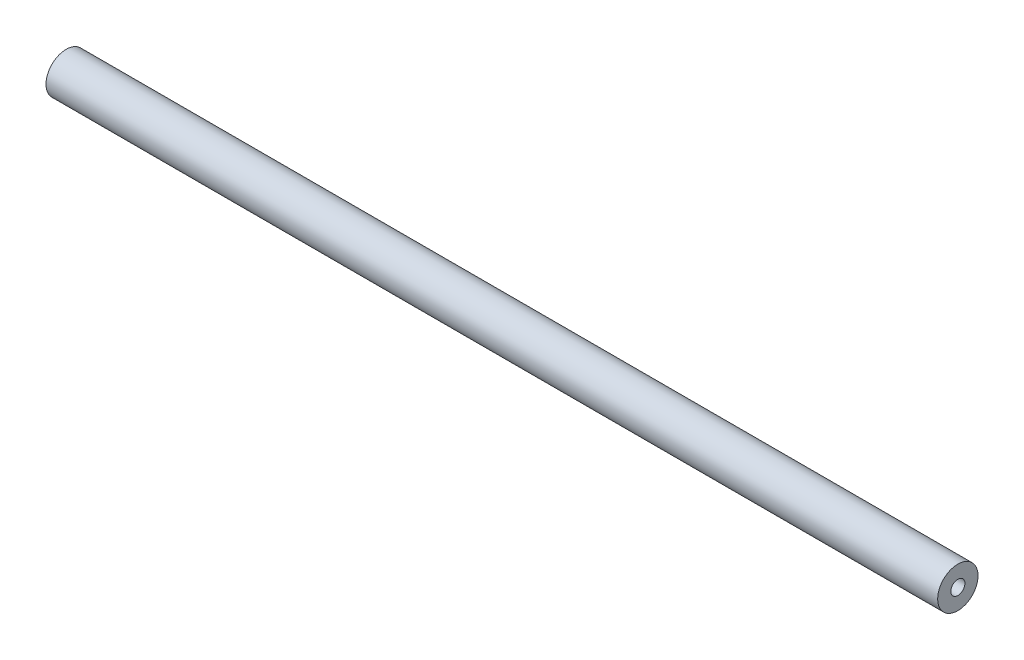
ISO-10303-21;
HEADER;
FILE_DESCRIPTION(('STEP AP214'),'2;1');
FILE_NAME('part.step','',(''),(''),'','','');
FILE_SCHEMA(('AUTOMOTIVE_DESIGN { 1 0 10303 214 1 1 1 1 }'));
ENDSEC;
DATA;
#1=APPLICATION_CONTEXT('core data for automotive mechanical design processes');
#2=APPLICATION_PROTOCOL_DEFINITION('international standard','automotive_design',2000,#1);
#3=PRODUCT_CONTEXT('',#1,'mechanical');
#4=PRODUCT('Part','Part','',(#3));
#5=PRODUCT_RELATED_PRODUCT_CATEGORY('part','',(#4));
#6=PRODUCT_DEFINITION_FORMATION('','',#4);
#7=PRODUCT_DEFINITION_CONTEXT('part definition',#1,'design');
#8=PRODUCT_DEFINITION('design','',#6,#7);
#9=PRODUCT_DEFINITION_SHAPE('','',#8);
#10=(LENGTH_UNIT() NAMED_UNIT(*) SI_UNIT(.MILLI.,.METRE.));
#11=(NAMED_UNIT(*) PLANE_ANGLE_UNIT() SI_UNIT($,.RADIAN.));
#12=(NAMED_UNIT(*) SI_UNIT($,.STERADIAN.) SOLID_ANGLE_UNIT());
#13=UNCERTAINTY_MEASURE_WITH_UNIT(LENGTH_MEASURE(1.E-05),#10,'distance_accuracy_value','');
#14=(GEOMETRIC_REPRESENTATION_CONTEXT(3) GLOBAL_UNCERTAINTY_ASSIGNED_CONTEXT((#13)) GLOBAL_UNIT_ASSIGNED_CONTEXT((#10,
#11,#12)) REPRESENTATION_CONTEXT('',''));
#15=CARTESIAN_POINT('',(0.,0.,0.));
#16=DIRECTION('',(0.,0.,1.));
#17=DIRECTION('',(1.,0.,0.));
#18=AXIS2_PLACEMENT_3D('',#15,#16,#17);
#19=CARTESIAN_POINT('',(250.99999999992,0.,0.));
#20=DIRECTION('',(1.,0.,0.));
#21=DIRECTION('',(0.,0.,-1.));
#22=AXIS2_PLACEMENT_3D('',#19,#20,#21);
#23=CONICAL_SURFACE('',#22,2.0999999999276,1.02974425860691);
#24=CARTESIAN_POINT('',(249.738192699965,0.,0.));
#25=VERTEX_POINT('',#24);
#26=VERTEX_LOOP('',#25);
#27=FACE_BOUND('',#26,.T.);
#28=CARTESIAN_POINT('',(251.,0.,0.));
#29=DIRECTION('',(1.,0.,0.));
#30=DIRECTION('',(0.,0.,-1.));
#31=AXIS2_PLACEMENT_3D('',#28,#29,#30);
#32=CIRCLE('',#31,2.1);
#33=CARTESIAN_POINT('',(251.,0.,-2.1));
#34=VERTEX_POINT('',#33);
#35=EDGE_CURVE('E37',#34,#34,#32,.T.);
#36=ORIENTED_EDGE('',*,*,#35,.T.);
#37=EDGE_LOOP('',(#36));
#38=FACE_BOUND('',#37,.T.);
#39=ADVANCED_FACE('F17',(#27,#38),#23,.F.);
#40=CARTESIAN_POINT('',(14.00000000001,0.,0.));
#41=DIRECTION('',(-1.,0.,0.));
#42=DIRECTION('',(0.,0.,1.));
#43=AXIS2_PLACEMENT_3D('',#40,#41,#42);
#44=CONICAL_SURFACE('',#43,2.10000000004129,1.02974425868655);
#45=CARTESIAN_POINT('',(15.2618072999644,0.,0.));
#46=VERTEX_POINT('',#45);
#47=VERTEX_LOOP('',#46);
#48=FACE_BOUND('',#47,.T.);
#49=CARTESIAN_POINT('',(14.,0.,0.));
#50=DIRECTION('',(-1.,0.,0.));
#51=DIRECTION('',(0.,0.,1.));
#52=AXIS2_PLACEMENT_3D('',#49,#50,#51);
#53=CIRCLE('',#52,2.09999999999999);
#54=CARTESIAN_POINT('',(14.,0.,2.09999999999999));
#55=VERTEX_POINT('',#54);
#56=EDGE_CURVE('E39',#55,#55,#53,.T.);
#57=ORIENTED_EDGE('',*,*,#56,.T.);
#58=EDGE_LOOP('',(#57));
#59=FACE_BOUND('',#58,.T.);
#60=ADVANCED_FACE('F34',(#48,#59),#44,.F.);
#61=CARTESIAN_POINT('',(265.,0.,0.));
#62=DIRECTION('',(1.,0.,0.));
#63=DIRECTION('',(0.,0.,-1.));
#64=AXIS2_PLACEMENT_3D('',#61,#62,#63);
#65=CYLINDRICAL_SURFACE('',#64,2.1);
#66=CARTESIAN_POINT('',(265.,0.,0.));
#67=DIRECTION('',(1.,0.,0.));
#68=DIRECTION('',(0.,0.,-1.));
#69=AXIS2_PLACEMENT_3D('',#66,#67,#68);
#70=CIRCLE('',#69,2.1);
#71=CARTESIAN_POINT('',(265.,0.,-2.1));
#72=VERTEX_POINT('',#71);
#73=EDGE_CURVE('E20',#72,#72,#70,.F.);
#74=ORIENTED_EDGE('',*,*,#73,.F.);
#75=EDGE_LOOP('',(#74));
#76=FACE_BOUND('',#75,.T.);
#77=ORIENTED_EDGE('',*,*,#35,.F.);
#78=EDGE_LOOP('',(#77));
#79=FACE_BOUND('',#78,.T.);
#80=ADVANCED_FACE('F54',(#76,#79),#65,.F.);
#81=CARTESIAN_POINT('',(0.,0.,0.));
#82=DIRECTION('',(-1.,0.,0.));
#83=DIRECTION('',(0.,0.,1.));
#84=AXIS2_PLACEMENT_3D('',#81,#82,#83);
#85=CYLINDRICAL_SURFACE('',#84,2.09999999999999);
#86=ORIENTED_EDGE('',*,*,#56,.F.);
#87=EDGE_LOOP('',(#86));
#88=FACE_BOUND('',#87,.T.);
#89=CARTESIAN_POINT('',(0.,0.,0.));
#90=DIRECTION('',(-1.,0.,0.));
#91=DIRECTION('',(0.,0.,1.));
#92=AXIS2_PLACEMENT_3D('',#89,#90,#91);
#93=CIRCLE('',#92,2.09999999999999);
#94=CARTESIAN_POINT('',(0.,0.,2.09999999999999));
#95=VERTEX_POINT('',#94);
#96=EDGE_CURVE('E45',#95,#95,#93,.T.);
#97=ORIENTED_EDGE('',*,*,#96,.T.);
#98=EDGE_LOOP('',(#97));
#99=FACE_BOUND('',#98,.T.);
#100=ADVANCED_FACE('F56',(#88,#99),#85,.F.);
#101=CARTESIAN_POINT('',(265.,0.,0.));
#102=DIRECTION('',(1.,0.,0.));
#103=DIRECTION('',(0.,0.,-1.));
#104=AXIS2_PLACEMENT_3D('',#101,#102,#103);
#105=PLANE('',#104);
#106=CARTESIAN_POINT('',(265.,0.,0.));
#107=DIRECTION('',(-1.,0.,0.));
#108=DIRECTION('',(0.,0.,1.));
#109=AXIS2_PLACEMENT_3D('',#106,#107,#108);
#110=CIRCLE('',#109,6.);
#111=CARTESIAN_POINT('',(265.,0.,6.));
#112=VERTEX_POINT('',#111);
#113=EDGE_CURVE('E26',#112,#112,#110,.T.);
#114=ORIENTED_EDGE('',*,*,#113,.F.);
#115=EDGE_LOOP('',(#114));
#116=FACE_BOUND('',#115,.T.);
#117=ORIENTED_EDGE('',*,*,#73,.T.);
#118=EDGE_LOOP('',(#117));
#119=FACE_BOUND('',#118,.T.);
#120=ADVANCED_FACE('F52',(#116,#119),#105,.T.);
#121=CARTESIAN_POINT('',(0.,0.,0.));
#122=DIRECTION('',(1.,0.,0.));
#123=DIRECTION('',(0.,0.,-1.));
#124=AXIS2_PLACEMENT_3D('',#121,#122,#123);
#125=PLANE('',#124);
#126=CARTESIAN_POINT('',(0.,0.,0.));
#127=DIRECTION('',(-1.,0.,0.));
#128=DIRECTION('',(0.,0.,1.));
#129=AXIS2_PLACEMENT_3D('',#126,#127,#128);
#130=CIRCLE('',#129,6.);
#131=CARTESIAN_POINT('',(0.,0.,6.));
#132=VERTEX_POINT('',#131);
#133=EDGE_CURVE('E11',#132,#132,#130,.F.);
#134=ORIENTED_EDGE('',*,*,#133,.F.);
#135=EDGE_LOOP('',(#134));
#136=FACE_BOUND('',#135,.T.);
#137=ORIENTED_EDGE('',*,*,#96,.F.);
#138=EDGE_LOOP('',(#137));
#139=FACE_BOUND('',#138,.T.);
#140=ADVANCED_FACE('F67',(#136,#139),#125,.F.);
#141=CARTESIAN_POINT('',(265.,0.,0.));
#142=DIRECTION('',(-1.,0.,0.));
#143=DIRECTION('',(0.,0.,1.));
#144=AXIS2_PLACEMENT_3D('',#141,#142,#143);
#145=CYLINDRICAL_SURFACE('',#144,6.);
#146=ORIENTED_EDGE('',*,*,#133,.T.);
#147=EDGE_LOOP('',(#146));
#148=FACE_BOUND('',#147,.T.);
#149=ORIENTED_EDGE('',*,*,#113,.T.);
#150=EDGE_LOOP('',(#149));
#151=FACE_BOUND('',#150,.T.);
#152=ADVANCED_FACE('F65',(#148,#151),#145,.T.);
#153=CLOSED_SHELL('',(#39,#60,#80,#100,#120,#140,#152));
#154=MANIFOLD_SOLID_BREP('B1',#153);
#155=ADVANCED_BREP_SHAPE_REPRESENTATION('',(#18,#154),#14);
#156=SHAPE_DEFINITION_REPRESENTATION(#9,#155);
ENDSEC;
END-ISO-10303-21;
